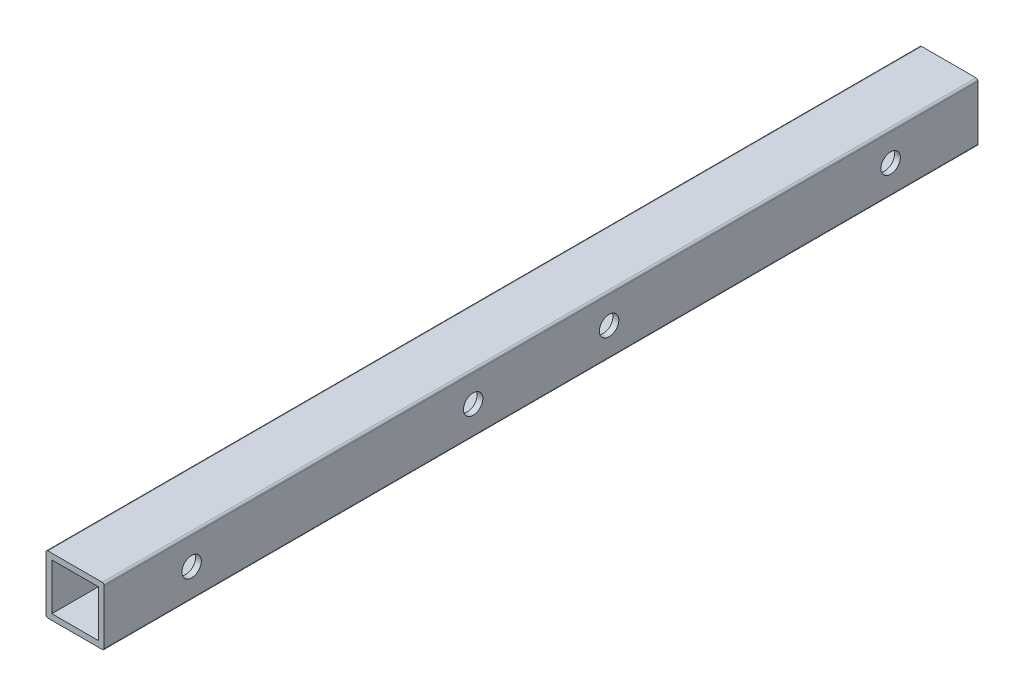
from build123d import *

# Parameters (mm, degrees)
ESQUISSE1_W             = 24
ESQUISSE1_H             = 24
BASE_EXTRU_MINCE_DEPTH  = 450
ESQUISSE5_R             = 5
ENL_V_MAT_EXTRU_1_DEPTH = 40


with BuildPart() as part:
    # Esquisse1 → Base-Extru.-Mince (new body)
    with BuildSketch(Plane.XY):
        with BuildLine():
            Line((14, -15), (-14, -15))
            ThreePointArc((-14, -15), (-14.707106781, -14.707106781), (-15, -14))
            Line((-15, -14), (-15, 14))
            ThreePointArc((-15, 14), (-14.707106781, 14.707106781), (-14, 15))
            Line((-14, 15), (14, 15))
            ThreePointArc((14, 15), (14.707106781, 14.707106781), (15, 14))
            Line((15, 14), (15, -14))
            ThreePointArc((15, -14), (14.707106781, -14.707106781), (14, -15))
        make_face()
        Rectangle(ESQUISSE1_W, ESQUISSE1_H, mode=Mode.SUBTRACT)
    extrude(amount=BASE_EXTRU_MINCE_DEPTH)

    # Esquisse5 → Enl_v. mat.-Extru.1 (cut)
    with BuildSketch(Plane.ZY.offset(15)):
        with Locations(Location((405, 0, 0), (0, 0, 270))):
            Circle(ESQUISSE5_R)
        with Locations(Location((190, 0, 0), (0, 0, 270))):
            Circle(ESQUISSE5_R)
        with Locations(Location((260, 0, 0), (0, 0, 270))):
            Circle(ESQUISSE5_R)
        with Locations(Location((45, 0, 0), (0, 0, 270))):
            Circle(ESQUISSE5_R)
    extrude(amount=-ENL_V_MAT_EXTRU_1_DEPTH, mode=Mode.SUBTRACT)


solid = part.part
